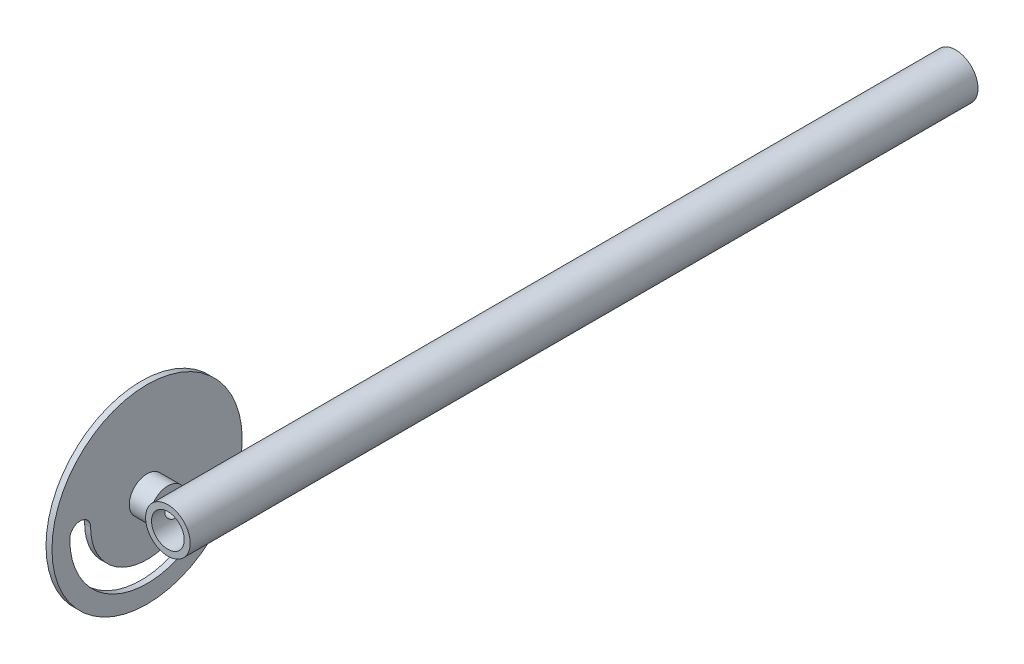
ISO-10303-21;
HEADER;
FILE_DESCRIPTION(('STEP AP214'),'2;1');
FILE_NAME('part.step','',(''),(''),'','','');
FILE_SCHEMA(('AUTOMOTIVE_DESIGN { 1 0 10303 214 1 1 1 1 }'));
ENDSEC;
DATA;
#1=APPLICATION_CONTEXT('core data for automotive mechanical design processes');
#2=APPLICATION_PROTOCOL_DEFINITION('international standard','automotive_design',2000,#1);
#3=PRODUCT_CONTEXT('',#1,'mechanical');
#4=PRODUCT('Part','Part','',(#3));
#5=PRODUCT_RELATED_PRODUCT_CATEGORY('part','',(#4));
#6=PRODUCT_DEFINITION_FORMATION('','',#4);
#7=PRODUCT_DEFINITION_CONTEXT('part definition',#1,'design');
#8=PRODUCT_DEFINITION('design','',#6,#7);
#9=PRODUCT_DEFINITION_SHAPE('','',#8);
#10=(LENGTH_UNIT() NAMED_UNIT(*) SI_UNIT(.MILLI.,.METRE.));
#11=(NAMED_UNIT(*) PLANE_ANGLE_UNIT() SI_UNIT($,.RADIAN.));
#12=(NAMED_UNIT(*) SI_UNIT($,.STERADIAN.) SOLID_ANGLE_UNIT());
#13=UNCERTAINTY_MEASURE_WITH_UNIT(LENGTH_MEASURE(1.E-05),#10,'distance_accuracy_value','');
#14=(GEOMETRIC_REPRESENTATION_CONTEXT(3) GLOBAL_UNCERTAINTY_ASSIGNED_CONTEXT((#13)) GLOBAL_UNIT_ASSIGNED_CONTEXT((#10,
#11,#12)) REPRESENTATION_CONTEXT('',''));
#15=CARTESIAN_POINT('',(0.,0.,0.));
#16=DIRECTION('',(0.,0.,1.));
#17=DIRECTION('',(1.,0.,0.));
#18=AXIS2_PLACEMENT_3D('',#15,#16,#17);
#19=CARTESIAN_POINT('',(-7.,0.,-7.));
#20=DIRECTION('',(1.,0.,0.));
#21=DIRECTION('',(0.,0.,-1.));
#22=AXIS2_PLACEMENT_3D('',#19,#20,#21);
#23=PLANE('',#22);
#24=DIRECTION('',(0.,0.,1.));
#25=VECTOR('',#24,1.);
#26=CARTESIAN_POINT('',(-7.,2.69258240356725,-265.));
#27=LINE('',#26,#25);
#28=CARTESIAN_POINT('',(-7.,2.69258240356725,-12.3619026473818));
#29=VERTEX_POINT('',#28);
#30=CARTESIAN_POINT('',(-7.,2.69258240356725,-1.6380973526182));
#31=VERTEX_POINT('',#30);
#32=EDGE_CURVE('E11',#29,#31,#27,.T.);
#33=ORIENTED_EDGE('',*,*,#32,.F.);
#34=CARTESIAN_POINT('',(-7.,0.,-7.));
#35=DIRECTION('',(1.,0.,0.));
#36=DIRECTION('',(0.,0.,-1.));
#37=AXIS2_PLACEMENT_3D('',#34,#35,#36);
#38=CIRCLE('',#37,6.);
#39=EDGE_CURVE('E85',#29,#31,#38,.T.);
#40=ORIENTED_EDGE('',*,*,#39,.T.);
#41=EDGE_LOOP('',(#33,#40));
#42=FACE_BOUND('',#41,.T.);
#43=ADVANCED_FACE('F32',(#42),#23,.T.);
#44=CARTESIAN_POINT('',(-16.,0.,-7.));
#45=DIRECTION('',(1.,0.,0.));
#46=DIRECTION('',(0.,0.,-1.));
#47=AXIS2_PLACEMENT_3D('',#44,#45,#46);
#48=CYLINDRICAL_SURFACE('',#47,32.);
#49=CARTESIAN_POINT('',(-16.,0.,-7.));
#50=DIRECTION('',(1.,0.,0.));
#51=DIRECTION('',(0.,0.,-1.));
#52=AXIS2_PLACEMENT_3D('',#49,#50,#51);
#53=CIRCLE('',#52,32.);
#54=CARTESIAN_POINT('',(-16.,0.,-39.));
#55=VERTEX_POINT('',#54);
#56=EDGE_CURVE('E97',#55,#55,#53,.T.);
#57=ORIENTED_EDGE('',*,*,#56,.T.);
#58=EDGE_LOOP('',(#57));
#59=FACE_BOUND('',#58,.T.);
#60=CARTESIAN_POINT('',(-14.,0.,-7.));
#61=DIRECTION('',(1.,0.,0.));
#62=DIRECTION('',(0.,0.,-1.));
#63=AXIS2_PLACEMENT_3D('',#60,#61,#62);
#64=CIRCLE('',#63,32.);
#65=CARTESIAN_POINT('',(-14.,0.,-39.));
#66=VERTEX_POINT('',#65);
#67=EDGE_CURVE('E99',#66,#66,#64,.T.);
#68=ORIENTED_EDGE('',*,*,#67,.F.);
#69=EDGE_LOOP('',(#68));
#70=FACE_BOUND('',#69,.T.);
#71=ADVANCED_FACE('F34',(#59,#70),#48,.T.);
#72=CARTESIAN_POINT('',(-16.,32.,-7.));
#73=DIRECTION('',(-1.,0.,0.));
#74=DIRECTION('',(0.,0.,1.));
#75=AXIS2_PLACEMENT_3D('',#72,#73,#74);
#76=PLANE('',#75);
#77=CARTESIAN_POINT('',(-16.,0.,-7.));
#78=DIRECTION('',(-1.,0.,0.));
#79=DIRECTION('',(0.,0.,1.));
#80=AXIS2_PLACEMENT_3D('',#77,#78,#79);
#81=CIRCLE('',#80,2.49999999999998);
#82=CARTESIAN_POINT('',(-16.,0.,-4.50000000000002));
#83=VERTEX_POINT('',#82);
#84=EDGE_CURVE('E301',#83,#83,#81,.T.);
#85=ORIENTED_EDGE('',*,*,#84,.F.);
#86=EDGE_LOOP('',(#85));
#87=FACE_BOUND('',#86,.T.);
#88=CARTESIAN_POINT('',(-16.,0.,15.5));
#89=DIRECTION('',(1.,0.,0.));
#90=DIRECTION('',(0.,0.,-1.));
#91=AXIS2_PLACEMENT_3D('',#88,#89,#90);
#92=CIRCLE('',#91,3.5);
#93=CARTESIAN_POINT('',(-16.,0.,12.));
#94=VERTEX_POINT('',#93);
#95=CARTESIAN_POINT('',(-16.,0.,19.));
#96=VERTEX_POINT('',#95);
#97=EDGE_CURVE('E117',#94,#96,#92,.T.);
#98=ORIENTED_EDGE('',*,*,#97,.T.);
#99=CARTESIAN_POINT('',(-16.,0.,-7.00000000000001));
#100=DIRECTION('',(1.,0.,0.));
#101=DIRECTION('',(0.,0.,-1.));
#102=AXIS2_PLACEMENT_3D('',#99,#100,#101);
#103=CIRCLE('',#102,26.);
#104=CARTESIAN_POINT('',(-16.,-18.3847763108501,-25.3847763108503));
#105=VERTEX_POINT('',#104);
#106=EDGE_CURVE('E131',#96,#105,#103,.T.);
#107=ORIENTED_EDGE('',*,*,#106,.T.);
#108=CARTESIAN_POINT('',(-16.,-15.9099025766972,-22.9099025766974));
#109=DIRECTION('',(1.,0.,0.));
#110=DIRECTION('',(0.,0.,-1.));
#111=AXIS2_PLACEMENT_3D('',#108,#109,#110);
#112=CIRCLE('',#111,3.5);
#113=CARTESIAN_POINT('',(-16.,-13.4350288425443,-20.4350288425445));
#114=VERTEX_POINT('',#113);
#115=EDGE_CURVE('E128',#105,#114,#112,.T.);
#116=ORIENTED_EDGE('',*,*,#115,.T.);
#117=CARTESIAN_POINT('',(-16.,0.,-7.00000000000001));
#118=DIRECTION('',(-1.,0.,0.));
#119=DIRECTION('',(0.,0.,1.));
#120=AXIS2_PLACEMENT_3D('',#117,#118,#119);
#121=CIRCLE('',#120,19.);
#122=EDGE_CURVE('E109',#114,#94,#121,.T.);
#123=ORIENTED_EDGE('',*,*,#122,.T.);
#124=EDGE_LOOP('',(#98,#107,#116,#123));
#125=FACE_BOUND('',#124,.T.);
#126=ORIENTED_EDGE('',*,*,#56,.F.);
#127=EDGE_LOOP('',(#126));
#128=FACE_BOUND('',#127,.T.);
#129=ADVANCED_FACE('F172',(#87,#125,#128),#76,.T.);
#130=CARTESIAN_POINT('',(-14.,0.,-7.));
#131=DIRECTION('',(1.,0.,0.));
#132=DIRECTION('',(0.,0.,-1.));
#133=AXIS2_PLACEMENT_3D('',#130,#131,#132);
#134=PLANE('',#133);
#135=CARTESIAN_POINT('',(-14.,0.,-7.));
#136=DIRECTION('',(1.,0.,0.));
#137=DIRECTION('',(0.,0.,-1.));
#138=AXIS2_PLACEMENT_3D('',#135,#136,#137);
#139=CIRCLE('',#138,6.);
#140=CARTESIAN_POINT('',(-14.,0.,-13.));
#141=VERTEX_POINT('',#140);
#142=EDGE_CURVE('E86',#141,#141,#139,.T.);
#143=ORIENTED_EDGE('',*,*,#142,.F.);
#144=EDGE_LOOP('',(#143));
#145=FACE_BOUND('',#144,.T.);
#146=CARTESIAN_POINT('',(-14.,0.,15.5));
#147=DIRECTION('',(1.,0.,0.));
#148=DIRECTION('',(0.,0.,-1.));
#149=AXIS2_PLACEMENT_3D('',#146,#147,#148);
#150=CIRCLE('',#149,3.5);
#151=CARTESIAN_POINT('',(-14.,0.,12.));
#152=VERTEX_POINT('',#151);
#153=CARTESIAN_POINT('',(-14.,0.,19.));
#154=VERTEX_POINT('',#153);
#155=EDGE_CURVE('E124',#152,#154,#150,.T.);
#156=ORIENTED_EDGE('',*,*,#155,.F.);
#157=CARTESIAN_POINT('',(-14.,0.,-7.00000000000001));
#158=DIRECTION('',(-1.,0.,0.));
#159=DIRECTION('',(0.,0.,1.));
#160=AXIS2_PLACEMENT_3D('',#157,#158,#159);
#161=CIRCLE('',#160,19.);
#162=CARTESIAN_POINT('',(-14.,-13.4350288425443,-20.4350288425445));
#163=VERTEX_POINT('',#162);
#164=EDGE_CURVE('E114',#163,#152,#161,.T.);
#165=ORIENTED_EDGE('',*,*,#164,.F.);
#166=CARTESIAN_POINT('',(-14.,-15.9099025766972,-22.9099025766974));
#167=DIRECTION('',(1.,0.,0.));
#168=DIRECTION('',(0.,0.,-1.));
#169=AXIS2_PLACEMENT_3D('',#166,#167,#168);
#170=CIRCLE('',#169,3.5);
#171=CARTESIAN_POINT('',(-14.,-18.3847763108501,-25.3847763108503));
#172=VERTEX_POINT('',#171);
#173=EDGE_CURVE('E118',#172,#163,#170,.T.);
#174=ORIENTED_EDGE('',*,*,#173,.F.);
#175=CARTESIAN_POINT('',(-14.,0.,-7.00000000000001));
#176=DIRECTION('',(1.,0.,0.));
#177=DIRECTION('',(0.,0.,-1.));
#178=AXIS2_PLACEMENT_3D('',#175,#176,#177);
#179=CIRCLE('',#178,26.);
#180=EDGE_CURVE('E121',#154,#172,#179,.T.);
#181=ORIENTED_EDGE('',*,*,#180,.F.);
#182=EDGE_LOOP('',(#156,#165,#174,#181));
#183=FACE_BOUND('',#182,.T.);
#184=ORIENTED_EDGE('',*,*,#67,.T.);
#185=EDGE_LOOP('',(#184));
#186=FACE_BOUND('',#185,.T.);
#187=ADVANCED_FACE('F177',(#145,#183,#186),#134,.T.);
#188=CARTESIAN_POINT('',(-16.,0.,15.5));
#189=DIRECTION('',(1.,0.,0.));
#190=DIRECTION('',(0.,0.,-1.));
#191=AXIS2_PLACEMENT_3D('',#188,#189,#190);
#192=CYLINDRICAL_SURFACE('',#191,3.5);
#193=ORIENTED_EDGE('',*,*,#155,.T.);
#194=DIRECTION('',(1.,0.,0.));
#195=VECTOR('',#194,1.);
#196=CARTESIAN_POINT('',(-16.,0.,19.));
#197=LINE('',#196,#195);
#198=EDGE_CURVE('E105',#96,#154,#197,.T.);
#199=ORIENTED_EDGE('',*,*,#198,.F.);
#200=ORIENTED_EDGE('',*,*,#97,.F.);
#201=DIRECTION('',(1.,0.,0.));
#202=VECTOR('',#201,1.);
#203=CARTESIAN_POINT('',(-16.,0.,12.));
#204=LINE('',#203,#202);
#205=EDGE_CURVE('E104',#94,#152,#204,.T.);
#206=ORIENTED_EDGE('',*,*,#205,.T.);
#207=EDGE_LOOP('',(#193,#199,#200,#206));
#208=FACE_BOUND('',#207,.T.);
#209=ADVANCED_FACE('F184',(#208),#192,.F.);
#210=CARTESIAN_POINT('',(-16.,0.,-7.00000000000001));
#211=DIRECTION('',(1.,0.,0.));
#212=DIRECTION('',(0.,0.,-1.));
#213=AXIS2_PLACEMENT_3D('',#210,#211,#212);
#214=CYLINDRICAL_SURFACE('',#213,19.);
#215=ORIENTED_EDGE('',*,*,#164,.T.);
#216=ORIENTED_EDGE('',*,*,#205,.F.);
#217=ORIENTED_EDGE('',*,*,#122,.F.);
#218=DIRECTION('',(1.,0.,0.));
#219=VECTOR('',#218,1.);
#220=CARTESIAN_POINT('',(-16.,-13.4350288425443,-20.4350288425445));
#221=LINE('',#220,#219);
#222=EDGE_CURVE('E111',#114,#163,#221,.T.);
#223=ORIENTED_EDGE('',*,*,#222,.T.);
#224=EDGE_LOOP('',(#215,#216,#217,#223));
#225=FACE_BOUND('',#224,.T.);
#226=ADVANCED_FACE('F190',(#225),#214,.T.);
#227=CARTESIAN_POINT('',(-16.,-15.9099025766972,-22.9099025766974));
#228=DIRECTION('',(1.,0.,0.));
#229=DIRECTION('',(0.,0.,-1.));
#230=AXIS2_PLACEMENT_3D('',#227,#228,#229);
#231=CYLINDRICAL_SURFACE('',#230,3.5);
#232=ORIENTED_EDGE('',*,*,#173,.T.);
#233=ORIENTED_EDGE('',*,*,#222,.F.);
#234=ORIENTED_EDGE('',*,*,#115,.F.);
#235=DIRECTION('',(1.,0.,0.));
#236=VECTOR('',#235,1.);
#237=CARTESIAN_POINT('',(-16.,-18.3847763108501,-25.3847763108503));
#238=LINE('',#237,#236);
#239=EDGE_CURVE('E108',#105,#172,#238,.T.);
#240=ORIENTED_EDGE('',*,*,#239,.T.);
#241=EDGE_LOOP('',(#232,#233,#234,#240));
#242=FACE_BOUND('',#241,.T.);
#243=ADVANCED_FACE('F198',(#242),#231,.F.);
#244=CARTESIAN_POINT('',(-16.,0.,-7.00000000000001));
#245=DIRECTION('',(1.,0.,0.));
#246=DIRECTION('',(0.,0.,-1.));
#247=AXIS2_PLACEMENT_3D('',#244,#245,#246);
#248=CYLINDRICAL_SURFACE('',#247,26.);
#249=ORIENTED_EDGE('',*,*,#180,.T.);
#250=ORIENTED_EDGE('',*,*,#239,.F.);
#251=ORIENTED_EDGE('',*,*,#106,.F.);
#252=ORIENTED_EDGE('',*,*,#198,.T.);
#253=EDGE_LOOP('',(#249,#250,#251,#252));
#254=FACE_BOUND('',#253,.T.);
#255=ADVANCED_FACE('F166',(#254),#248,.F.);
#256=CARTESIAN_POINT('',(-7.,0.,-7.));
#257=DIRECTION('',(-1.,0.,0.));
#258=DIRECTION('',(0.,0.,1.));
#259=AXIS2_PLACEMENT_3D('',#256,#257,#258);
#260=CYLINDRICAL_SURFACE('',#259,6.);
#261=CARTESIAN_POINT('',(-7.,-2.69258240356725,-1.6380973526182));
#262=VERTEX_POINT('',#261);
#263=CARTESIAN_POINT('',(-7.,-2.69258240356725,-12.3619026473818));
#264=VERTEX_POINT('',#263);
#265=EDGE_CURVE('E82',#262,#264,#38,.T.);
#266=ORIENTED_EDGE('',*,*,#265,.F.);
#267=CARTESIAN_POINT('',(-7.,-2.69258240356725,-1.6380973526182));
#268=CARTESIAN_POINT('',(-7.04575008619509,-2.57368241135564,-1.57837787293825));
#269=CARTESIAN_POINT('',(-7.08906383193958,-2.45199895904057,-1.52223650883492));
#270=CARTESIAN_POINT('',(-7.17019230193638,-2.203493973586,-1.41763756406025));
#271=CARTESIAN_POINT('',(-7.20800301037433,-2.07666877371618,-1.36918559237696));
#272=CARTESIAN_POINT('',(-7.27752633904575,-1.81812771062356,-1.28045932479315));
#273=CARTESIAN_POINT('',(-7.30922187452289,-1.68639933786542,-1.24020792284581));
#274=CARTESIAN_POINT('',(-7.36577888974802,-1.41913645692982,-1.16860372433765));
#275=CARTESIAN_POINT('',(-7.39064199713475,-1.28360286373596,-1.13724880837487));
#276=CARTESIAN_POINT('',(-7.43313188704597,-1.00893464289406,-1.0837753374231));
#277=CARTESIAN_POINT('',(-7.45072474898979,-0.869786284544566,-1.06170007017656));
#278=CARTESIAN_POINT('',(-7.47812011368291,-0.589525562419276,-1.02736340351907));
#279=CARTESIAN_POINT('',(-7.48792301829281,-0.448413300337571,-1.01510149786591));
#280=CARTESIAN_POINT('',(-7.49950364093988,-0.165624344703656,-1.00061888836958));
#281=CARTESIAN_POINT('',(-7.50129717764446,-0.023949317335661,-0.998378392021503));
#282=CARTESIAN_POINT('',(-7.49686001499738,0.259068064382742,-1.00392519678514));
#283=CARTESIAN_POINT('',(-7.49062997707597,0.400410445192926,-1.01171167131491));
#284=CARTESIAN_POINT('',(-7.47091305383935,0.67304342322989,-1.03639432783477));
#285=CARTESIAN_POINT('',(-7.45789172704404,0.804421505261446,-1.05270620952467));
#286=CARTESIAN_POINT('',(-7.42515504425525,1.06504868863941,-1.09380986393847));
#287=CARTESIAN_POINT('',(-7.40543703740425,1.19429692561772,-1.11860499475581));
#288=CARTESIAN_POINT('',(-7.35967052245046,1.44986622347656,-1.17633621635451));
#289=CARTESIAN_POINT('',(-7.33361943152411,1.57618606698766,-1.20927562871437));
#290=CARTESIAN_POINT('',(-7.27564788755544,1.82518253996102,-1.28287089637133));
#291=CARTESIAN_POINT('',(-7.24372697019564,1.94785888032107,-1.32352736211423));
#292=CARTESIAN_POINT('',(-7.1782157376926,2.17618602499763,-1.40738041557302));
#293=CARTESIAN_POINT('',(-7.14516287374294,2.28226119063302,-1.44984851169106));
#294=CARTESIAN_POINT('',(-7.0753063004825,2.49039598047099,-1.54007684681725));
#295=CARTESIAN_POINT('',(-7.03851587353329,2.59246815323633,-1.58781839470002));
#296=CARTESIAN_POINT('',(-7.,2.69258240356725,-1.6380973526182));
#297=B_SPLINE_CURVE_WITH_KNOTS('',3,(#267,#268,#269,#270,#271,#272,#273,#274,#275,#276,#277,
#278,#279,#280,#281,#282,#283,#284,#285,#286,#287,#288,#289,#290,#291,#292,#293,#294,#295,#296),
.UNSPECIFIED.,.F.,.F.,(4,2,2,2,2,2,2,2,2,2,2,2,2,2,4),(0.,0.422070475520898,0.844447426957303,
1.26798786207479,1.69142731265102,2.11682067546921,2.54219209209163,2.96672301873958,
3.39121895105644,3.7898360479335,4.18861112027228,4.58754909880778,4.98651864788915,
5.3431108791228,5.69847748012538),.UNSPECIFIED.);
#298=EDGE_CURVE('E52',#262,#31,#297,.T.);
#299=ORIENTED_EDGE('',*,*,#298,.T.);
#300=ORIENTED_EDGE('',*,*,#39,.F.);
#301=CARTESIAN_POINT('',(-7.,2.69258240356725,-12.3619026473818));
#302=CARTESIAN_POINT('',(-7.04575008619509,2.57368241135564,-12.4216221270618));
#303=CARTESIAN_POINT('',(-7.08906383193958,2.45199895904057,-12.4777634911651));
#304=CARTESIAN_POINT('',(-7.17019230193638,2.203493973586,-12.5823624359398));
#305=CARTESIAN_POINT('',(-7.20800301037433,2.07666877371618,-12.630814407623));
#306=CARTESIAN_POINT('',(-7.27752633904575,1.81812771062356,-12.7195406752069));
#307=CARTESIAN_POINT('',(-7.30922187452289,1.68639933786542,-12.7597920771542));
#308=CARTESIAN_POINT('',(-7.36577888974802,1.41913645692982,-12.8313962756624));
#309=CARTESIAN_POINT('',(-7.39064199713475,1.28360286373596,-12.8627511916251));
#310=CARTESIAN_POINT('',(-7.43313188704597,1.00893464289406,-12.9162246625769));
#311=CARTESIAN_POINT('',(-7.45072474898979,0.869786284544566,-12.9382999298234));
#312=CARTESIAN_POINT('',(-7.47812011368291,0.589525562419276,-12.9726365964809));
#313=CARTESIAN_POINT('',(-7.48792301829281,0.448413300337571,-12.9848985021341));
#314=CARTESIAN_POINT('',(-7.49950364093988,0.165624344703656,-12.9993811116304));
#315=CARTESIAN_POINT('',(-7.50129717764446,0.0239493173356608,-13.0016216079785));
#316=CARTESIAN_POINT('',(-7.49686001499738,-0.259068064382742,-12.9960748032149));
#317=CARTESIAN_POINT('',(-7.49062997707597,-0.400410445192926,-12.9882883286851));
#318=CARTESIAN_POINT('',(-7.47091305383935,-0.67304342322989,-12.9636056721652));
#319=CARTESIAN_POINT('',(-7.45789172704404,-0.804421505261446,-12.9472937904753));
#320=CARTESIAN_POINT('',(-7.42515504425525,-1.06504868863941,-12.9061901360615));
#321=CARTESIAN_POINT('',(-7.40543703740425,-1.19429692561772,-12.8813950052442));
#322=CARTESIAN_POINT('',(-7.35967052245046,-1.44986622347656,-12.8236637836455));
#323=CARTESIAN_POINT('',(-7.33361943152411,-1.57618606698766,-12.7907243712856));
#324=CARTESIAN_POINT('',(-7.27564788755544,-1.82518253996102,-12.7171291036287));
#325=CARTESIAN_POINT('',(-7.24372697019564,-1.94785888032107,-12.6764726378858));
#326=CARTESIAN_POINT('',(-7.1782157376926,-2.17618602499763,-12.592619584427));
#327=CARTESIAN_POINT('',(-7.14516287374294,-2.28226119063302,-12.550151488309));
#328=CARTESIAN_POINT('',(-7.0753063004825,-2.49039598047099,-12.4599231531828));
#329=CARTESIAN_POINT('',(-7.03851587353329,-2.59246815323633,-12.4121816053));
#330=CARTESIAN_POINT('',(-7.,-2.69258240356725,-12.3619026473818));
#331=B_SPLINE_CURVE_WITH_KNOTS('',3,(#301,#302,#303,#304,#305,#306,#307,#308,#309,#310,#311,
#312,#313,#314,#315,#316,#317,#318,#319,#320,#321,#322,#323,#324,#325,#326,#327,#328,#329,#330),
.UNSPECIFIED.,.F.,.F.,(4,2,2,2,2,2,2,2,2,2,2,2,2,2,4),(0.,0.422070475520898,0.844447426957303,
1.26798786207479,1.69142731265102,2.11682067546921,2.54219209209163,2.96672301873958,
3.39121895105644,3.7898360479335,4.18861112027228,4.58754909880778,4.98651864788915,
5.3431108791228,5.69847748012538),.UNSPECIFIED.);
#332=EDGE_CURVE('E89',#29,#264,#331,.T.);
#333=ORIENTED_EDGE('',*,*,#332,.T.);
#334=EDGE_LOOP('',(#266,#299,#300,#333));
#335=FACE_BOUND('',#334,.T.);
#336=ORIENTED_EDGE('',*,*,#142,.T.);
#337=EDGE_LOOP('',(#336));
#338=FACE_BOUND('',#337,.T.);
#339=ADVANCED_FACE('F90',(#335,#338),#260,.T.);
#340=DIRECTION('',(0.,0.,1.));
#341=VECTOR('',#340,1.);
#342=CARTESIAN_POINT('',(-7.,-2.69258240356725,-265.));
#343=LINE('',#342,#341);
#344=EDGE_CURVE('E40',#262,#264,#343,.F.);
#345=ORIENTED_EDGE('',*,*,#344,.F.);
#346=ORIENTED_EDGE('',*,*,#265,.T.);
#347=EDGE_LOOP('',(#345,#346));
#348=FACE_BOUND('',#347,.T.);
#349=ADVANCED_FACE('F84',(#348),#23,.T.);
#350=CARTESIAN_POINT('',(0.,0.,0.));
#351=DIRECTION('',(0.,0.,1.));
#352=DIRECTION('',(1.,0.,0.));
#353=AXIS2_PLACEMENT_3D('',#350,#351,#352);
#354=PLANE('',#353);
#355=CARTESIAN_POINT('',(0.,0.,0.));
#356=DIRECTION('',(0.,0.,1.));
#357=DIRECTION('',(1.,0.,0.));
#358=AXIS2_PLACEMENT_3D('',#355,#356,#357);
#359=CIRCLE('',#358,5.49999999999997);
#360=CARTESIAN_POINT('',(5.49999999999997,0.,0.));
#361=VERTEX_POINT('',#360);
#362=EDGE_CURVE('E304',#361,#361,#359,.T.);
#363=ORIENTED_EDGE('',*,*,#362,.F.);
#364=EDGE_LOOP('',(#363));
#365=FACE_BOUND('',#364,.T.);
#366=CARTESIAN_POINT('',(0.,0.,0.));
#367=DIRECTION('',(0.,0.,1.));
#368=DIRECTION('',(1.,0.,0.));
#369=AXIS2_PLACEMENT_3D('',#366,#367,#368);
#370=CIRCLE('',#369,7.5);
#371=CARTESIAN_POINT('',(7.5,0.,0.));
#372=VERTEX_POINT('',#371);
#373=EDGE_CURVE('E93',#372,#372,#370,.T.);
#374=ORIENTED_EDGE('',*,*,#373,.T.);
#375=EDGE_LOOP('',(#374));
#376=FACE_BOUND('',#375,.T.);
#377=ADVANCED_FACE('F157',(#365,#376),#354,.T.);
#378=CARTESIAN_POINT('',(0.,0.,-265.));
#379=DIRECTION('',(0.,0.,1.));
#380=DIRECTION('',(1.,0.,0.));
#381=AXIS2_PLACEMENT_3D('',#378,#379,#380);
#382=CYLINDRICAL_SURFACE('',#381,7.5);
#383=ORIENTED_EDGE('',*,*,#332,.F.);
#384=ORIENTED_EDGE('',*,*,#32,.T.);
#385=ORIENTED_EDGE('',*,*,#298,.F.);
#386=ORIENTED_EDGE('',*,*,#344,.T.);
#387=EDGE_LOOP('',(#383,#384,#385,#386));
#388=FACE_BOUND('',#387,.T.);
#389=CARTESIAN_POINT('',(0.,0.,-265.));
#390=DIRECTION('',(0.,0.,1.));
#391=DIRECTION('',(1.,0.,0.));
#392=AXIS2_PLACEMENT_3D('',#389,#390,#391);
#393=CIRCLE('',#392,7.5);
#394=CARTESIAN_POINT('',(7.5,0.,-265.));
#395=VERTEX_POINT('',#394);
#396=EDGE_CURVE('E307',#395,#395,#393,.T.);
#397=ORIENTED_EDGE('',*,*,#396,.T.);
#398=EDGE_LOOP('',(#397));
#399=FACE_BOUND('',#398,.T.);
#400=ORIENTED_EDGE('',*,*,#373,.F.);
#401=EDGE_LOOP('',(#400));
#402=FACE_BOUND('',#401,.T.);
#403=ADVANCED_FACE('F95',(#388,#399,#402),#382,.T.);
#404=CARTESIAN_POINT('',(7.5,0.,-265.));
#405=DIRECTION('',(0.,0.,-1.));
#406=DIRECTION('',(-1.,0.,0.));
#407=AXIS2_PLACEMENT_3D('',#404,#405,#406);
#408=PLANE('',#407);
#409=CARTESIAN_POINT('',(0.,0.,-265.));
#410=DIRECTION('',(0.,0.,-1.));
#411=DIRECTION('',(-1.,0.,0.));
#412=AXIS2_PLACEMENT_3D('',#409,#410,#411);
#413=CIRCLE('',#412,5.49999999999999);
#414=CARTESIAN_POINT('',(-5.49999999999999,0.,-265.));
#415=VERTEX_POINT('',#414);
#416=EDGE_CURVE('E300',#415,#415,#413,.T.);
#417=ORIENTED_EDGE('',*,*,#416,.F.);
#418=EDGE_LOOP('',(#417));
#419=FACE_BOUND('',#418,.T.);
#420=ORIENTED_EDGE('',*,*,#396,.F.);
#421=EDGE_LOOP('',(#420));
#422=FACE_BOUND('',#421,.T.);
#423=ADVANCED_FACE('F156',(#419,#422),#408,.T.);
#424=CARTESIAN_POINT('',(0.,0.,-265.));
#425=DIRECTION('',(0.,0.,-1.));
#426=DIRECTION('',(-1.,0.,0.));
#427=AXIS2_PLACEMENT_3D('',#424,#425,#426);
#428=CYLINDRICAL_SURFACE('',#427,5.49999999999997);
#429=CARTESIAN_POINT('',(-5.49999999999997,0.,-4.50000000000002));
#430=CARTESIAN_POINT('',(-5.49999369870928,0.132816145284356,-4.5000077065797));
#431=CARTESIAN_POINT('',(-5.49513526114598,0.265835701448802,-4.51064708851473));
#432=CARTESIAN_POINT('',(-5.47618102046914,0.528027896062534,-4.55277708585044));
#433=CARTESIAN_POINT('',(-5.46206378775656,0.657190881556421,-4.58431607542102));
#434=CARTESIAN_POINT('',(-5.426087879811,0.907466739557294,-4.66680544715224));
#435=CARTESIAN_POINT('',(-5.40425732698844,1.02860698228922,-4.71768536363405));
#436=CARTESIAN_POINT('',(-5.35492606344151,1.26049169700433,-4.83708941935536));
#437=CARTESIAN_POINT('',(-5.32742648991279,1.37123824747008,-4.90561002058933));
#438=CARTESIAN_POINT('',(-5.26767788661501,1.58575279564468,-5.06248592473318));
#439=CARTESIAN_POINT('',(-5.23525516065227,1.68884771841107,-5.15169467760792));
#440=CARTESIAN_POINT('',(-5.16998160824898,1.87921167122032,-5.34559891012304));
#441=CARTESIAN_POINT('',(-5.13713052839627,1.96647083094,-5.45030397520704));
#442=CARTESIAN_POINT('',(-5.07244492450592,2.12798843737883,-5.67994494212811));
#443=CARTESIAN_POINT('',(-5.04079497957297,2.2011275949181,-5.8057258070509));
#444=CARTESIAN_POINT('',(-4.98491966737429,2.32491325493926,-6.069432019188));
#445=CARTESIAN_POINT('',(-4.96068978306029,2.37557345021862,-6.20734991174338));
#446=CARTESIAN_POINT('',(-4.92431404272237,2.45005627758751,-6.48369548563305));
#447=CARTESIAN_POINT('',(-4.91158514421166,2.47518302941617,-6.62169158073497));
#448=CARTESIAN_POINT('',(-4.89801821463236,2.50193279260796,-6.90048194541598));
#449=CARTESIAN_POINT('',(-4.89717166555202,2.50357264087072,-7.04127413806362));
#450=CARTESIAN_POINT('',(-4.90698153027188,2.48427141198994,-7.30741072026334));
#451=CARTESIAN_POINT('',(-4.91655818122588,2.46545016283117,-7.43295732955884));
#452=CARTESIAN_POINT('',(-4.94428109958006,2.40936765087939,-7.6788660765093));
#453=CARTESIAN_POINT('',(-4.96242941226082,2.37210198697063,-7.79922696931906));
#454=CARTESIAN_POINT('',(-5.00567208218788,2.2794518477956,-8.03463657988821));
#455=CARTESIAN_POINT('',(-5.03091516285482,2.22367420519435,-8.14950198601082));
#456=CARTESIAN_POINT('',(-5.0854848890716,2.09586859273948,-8.3687414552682));
#457=CARTESIAN_POINT('',(-5.11481328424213,2.02383365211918,-8.47311099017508));
#458=CARTESIAN_POINT('',(-5.17789221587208,1.85692478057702,-8.67964656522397));
#459=CARTESIAN_POINT('',(-5.21178805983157,1.76046753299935,-8.78049273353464));
#460=CARTESIAN_POINT('',(-5.27769368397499,1.55174815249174,-8.96506827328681));
#461=CARTESIAN_POINT('',(-5.30970283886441,1.43948082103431,-9.0487919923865));
#462=CARTESIAN_POINT('',(-5.36950534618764,1.19766281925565,-9.19920668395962));
#463=CARTESIAN_POINT('',(-5.39712978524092,1.06767206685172,-9.26526247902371));
#464=CARTESIAN_POINT('',(-5.44369936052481,0.796844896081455,-9.37408839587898));
#465=CARTESIAN_POINT('',(-5.46265022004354,0.656015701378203,-9.41687387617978));
#466=CARTESIAN_POINT('',(-5.488604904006,0.37844991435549,-9.47495536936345));
#467=CARTESIAN_POINT('',(-5.49637394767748,0.242154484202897,-9.49201639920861));
#468=CARTESIAN_POINT('',(-5.50161007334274,-0.0315660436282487,-9.50354688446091));
#469=CARTESIAN_POINT('',(-5.49908087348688,-0.16899071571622,-9.49802449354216));
#470=CARTESIAN_POINT('',(-5.48448407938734,-0.432146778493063,-9.46571419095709));
#471=CARTESIAN_POINT('',(-5.47301153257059,-0.558078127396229,-9.44025247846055));
#472=CARTESIAN_POINT('',(-5.44237110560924,-0.803693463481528,-9.37073267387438));
#473=CARTESIAN_POINT('',(-5.42320230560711,-0.923376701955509,-9.32667235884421));
#474=CARTESIAN_POINT('',(-5.37821815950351,-1.15732747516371,-9.21983025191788));
#475=CARTESIAN_POINT('',(-5.35221506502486,-1.27131180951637,-9.15651006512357));
#476=CARTESIAN_POINT('',(-5.29622400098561,-1.48744614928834,-9.013532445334));
#477=CARTESIAN_POINT('',(-5.26623428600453,-1.58959093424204,-8.93386784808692));
#478=CARTESIAN_POINT('',(-5.20232138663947,-1.7881912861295,-8.75268934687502));
#479=CARTESIAN_POINT('',(-5.16827928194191,-1.88345063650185,-8.64990310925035));
#480=CARTESIAN_POINT('',(-5.10218027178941,-2.05579555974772,-8.42943763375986));
#481=CARTESIAN_POINT('',(-5.07012418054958,-2.1328737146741,-8.31175234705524));
#482=CARTESIAN_POINT('',(-5.01093675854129,-2.26851417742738,-8.06054583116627));
#483=CARTESIAN_POINT('',(-4.98396428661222,-2.32651178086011,-7.92667925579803));
#484=CARTESIAN_POINT('',(-4.93995555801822,-2.41857144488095,-7.6494505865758));
#485=CARTESIAN_POINT('',(-4.92290900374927,-2.45265831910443,-7.50609850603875));
#486=CARTESIAN_POINT('',(-4.90246200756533,-2.49325807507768,-7.2274373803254));
#487=CARTESIAN_POINT('',(-4.89799994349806,-2.50191885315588,-7.09251907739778));
#488=CARTESIAN_POINT('',(-4.90032179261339,-2.4973702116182,-6.82316690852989));
#489=CARTESIAN_POINT('',(-4.90710299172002,-2.48416607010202,-6.68873293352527));
#490=CARTESIAN_POINT('',(-4.93010341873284,-2.43816849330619,-6.43337370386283));
#491=CARTESIAN_POINT('',(-4.9456728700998,-2.40671995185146,-6.31214138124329));
#492=CARTESIAN_POINT('',(-4.98386936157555,-2.32658661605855,-6.07670718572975));
#493=CARTESIAN_POINT('',(-5.00649846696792,-2.27789677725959,-5.96250738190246));
#494=CARTESIAN_POINT('',(-5.05808484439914,-2.16104195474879,-5.73621296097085));
#495=CARTESIAN_POINT('',(-5.0873584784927,-2.09181431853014,-5.62474088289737));
#496=CARTESIAN_POINT('',(-5.14822130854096,-1.93719380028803,-5.41433129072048));
#497=CARTESIAN_POINT('',(-5.1798115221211,-1.85179378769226,-5.3153993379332));
#498=CARTESIAN_POINT('',(-5.24527901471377,-1.65784520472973,-5.12333979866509));
#499=CARTESIAN_POINT('',(-5.27909503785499,-1.54788097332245,-5.03161259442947));
#500=CARTESIAN_POINT('',(-5.34236067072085,-1.31300676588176,-4.8677385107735));
#501=CARTESIAN_POINT('',(-5.37180825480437,-1.18808990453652,-4.79560070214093));
#502=CARTESIAN_POINT('',(-5.42285296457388,-0.927398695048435,-4.67397870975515));
#503=CARTESIAN_POINT('',(-5.44451694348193,-0.791729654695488,-4.62430061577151));
#504=CARTESIAN_POINT('',(-5.46948623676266,-0.582817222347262,-4.56781082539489));
#505=CARTESIAN_POINT('',(-5.47655224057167,-0.512336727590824,-4.55199091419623));
#506=CARTESIAN_POINT('',(-5.48799750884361,-0.370074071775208,-4.52648988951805));
#507=CARTESIAN_POINT('',(-5.49237860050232,-0.29829283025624,-4.51680460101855));
#508=CARTESIAN_POINT('',(-5.49689395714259,-0.188612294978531,-4.50683913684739));
#509=CARTESIAN_POINT('',(-5.49805724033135,-0.150946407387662,-4.5042761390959));
#510=CARTESIAN_POINT('',(-5.49961116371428,-0.0755258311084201,-4.5008554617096));
#511=CARTESIAN_POINT('',(-5.50000179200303,-0.0377711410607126,-4.4999978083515));
#512=CARTESIAN_POINT('',(-5.49999999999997,0.,-4.50000000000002));
#513=B_SPLINE_CURVE_WITH_KNOTS('',3,(#429,#430,#431,#432,#433,#434,#435,#436,#437,#438,#439,
#440,#441,#442,#443,#444,#445,#446,#447,#448,#449,#450,#451,#452,#453,#454,#455,#456,#457,#458,
#459,#460,#461,#462,#463,#464,#465,#466,#467,#468,#469,#470,#471,#472,#473,#474,#475,#476,#477,
#478,#479,#480,#481,#482,#483,#484,#485,#486,#487,#488,#489,#490,#491,#492,#493,#494,#495,#496,
#497,#498,#499,#500,#501,#502,#503,#504,#505,#506,#507,#508,#509,#510,#511,#512),.UNSPECIFIED.,
.T.,.F.,(4,2,2,2,2,2,2,2,2,2,2,2,2,2,2,2,2,2,2,2,2,2,2,2,2,2,2,2,2,2,2,2,2,2,2,2,2,2,2,2,2,4),
(0.,0.3983009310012,0.797527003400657,1.19531228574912,1.59301785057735,2.01163405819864,
2.43051029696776,2.87496551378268,3.31914962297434,3.73929338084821,4.15913593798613,
4.53929253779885,4.91953989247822,5.30844370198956,5.69751458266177,6.12642368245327,
6.5554741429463,6.99833839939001,7.44091000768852,7.85145915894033,8.26186009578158,
8.64706845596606,9.03232287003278,9.42952911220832,9.82690983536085,10.2576285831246,
10.6885227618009,11.1312140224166,11.5734451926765,11.9770599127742,12.3805772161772,
12.7575667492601,13.1346666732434,13.5363493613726,13.9382095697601,14.3775242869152,
14.817042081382,15.2526891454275,15.470165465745,15.6874936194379,15.8007633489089,
15.9140348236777),.UNSPECIFIED.);
#514=CARTESIAN_POINT('',(-5.49999999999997,0.,-4.50000000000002));
#515=VERTEX_POINT('',#514);
#516=EDGE_CURVE('E293',#515,#515,#513,.T.);
#517=ORIENTED_EDGE('',*,*,#516,.T.);
#518=EDGE_LOOP('',(#517));
#519=FACE_BOUND('',#518,.T.);
#520=ORIENTED_EDGE('',*,*,#362,.T.);
#521=EDGE_LOOP('',(#520));
#522=FACE_BOUND('',#521,.T.);
#523=ORIENTED_EDGE('',*,*,#416,.T.);
#524=EDGE_LOOP('',(#523));
#525=FACE_BOUND('',#524,.T.);
#526=ADVANCED_FACE('F257',(#519,#522,#525),#428,.F.);
#527=CARTESIAN_POINT('',(-16.,0.,-7.));
#528=DIRECTION('',(-1.,0.,0.));
#529=DIRECTION('',(0.,0.,1.));
#530=AXIS2_PLACEMENT_3D('',#527,#528,#529);
#531=CYLINDRICAL_SURFACE('',#530,2.49999999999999);
#532=ORIENTED_EDGE('',*,*,#516,.F.);
#533=EDGE_LOOP('',(#532));
#534=FACE_BOUND('',#533,.T.);
#535=ORIENTED_EDGE('',*,*,#84,.T.);
#536=EDGE_LOOP('',(#535));
#537=FACE_BOUND('',#536,.T.);
#538=ADVANCED_FACE('F274',(#534,#537),#531,.F.);
#539=CLOSED_SHELL('',(#43,#71,#129,#187,#209,#226,#243,#255,#339,#349,#377,#403,#423,#526,#538));
#540=MANIFOLD_SOLID_BREP('B2',#539);
#541=ADVANCED_BREP_SHAPE_REPRESENTATION('',(#18,#540),#14);
#542=SHAPE_DEFINITION_REPRESENTATION(#9,#541);
ENDSEC;
END-ISO-10303-21;
